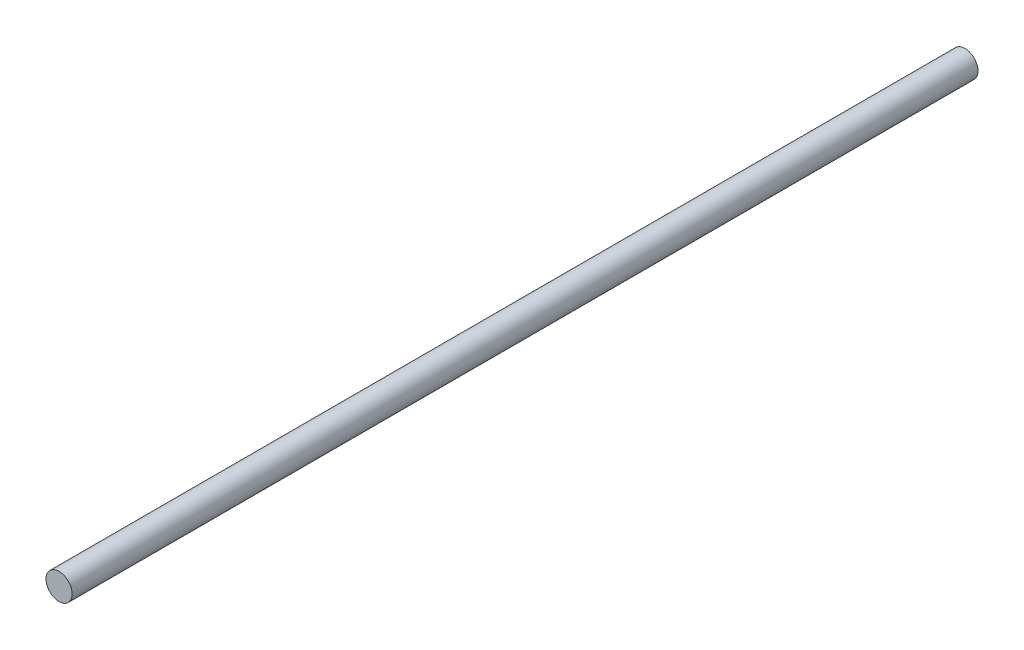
ISO-10303-21;
HEADER;
FILE_DESCRIPTION(('STEP AP214'),'2;1');
FILE_NAME('part.step','',(''),(''),'','','');
FILE_SCHEMA(('AUTOMOTIVE_DESIGN { 1 0 10303 214 1 1 1 1 }'));
ENDSEC;
DATA;
#1=APPLICATION_CONTEXT('core data for automotive mechanical design processes');
#2=APPLICATION_PROTOCOL_DEFINITION('international standard','automotive_design',2000,#1);
#3=PRODUCT_CONTEXT('',#1,'mechanical');
#4=PRODUCT('Part','Part','',(#3));
#5=PRODUCT_RELATED_PRODUCT_CATEGORY('part','',(#4));
#6=PRODUCT_DEFINITION_FORMATION('','',#4);
#7=PRODUCT_DEFINITION_CONTEXT('part definition',#1,'design');
#8=PRODUCT_DEFINITION('design','',#6,#7);
#9=PRODUCT_DEFINITION_SHAPE('','',#8);
#10=(LENGTH_UNIT() NAMED_UNIT(*) SI_UNIT(.MILLI.,.METRE.));
#11=(NAMED_UNIT(*) PLANE_ANGLE_UNIT() SI_UNIT($,.RADIAN.));
#12=(NAMED_UNIT(*) SI_UNIT($,.STERADIAN.) SOLID_ANGLE_UNIT());
#13=UNCERTAINTY_MEASURE_WITH_UNIT(LENGTH_MEASURE(1.E-05),#10,'distance_accuracy_value','');
#14=(GEOMETRIC_REPRESENTATION_CONTEXT(3) GLOBAL_UNCERTAINTY_ASSIGNED_CONTEXT((#13)) GLOBAL_UNIT_ASSIGNED_CONTEXT((#10,
#11,#12)) REPRESENTATION_CONTEXT('',''));
#15=CARTESIAN_POINT('',(0.,0.,0.));
#16=DIRECTION('',(0.,0.,1.));
#17=DIRECTION('',(1.,0.,0.));
#18=AXIS2_PLACEMENT_3D('',#15,#16,#17);
#19=CARTESIAN_POINT('',(0.,0.,220.));
#20=DIRECTION('',(0.,0.,-1.));
#21=DIRECTION('',(-1.,0.,0.));
#22=AXIS2_PLACEMENT_3D('',#19,#20,#21);
#23=CYLINDRICAL_SURFACE('',#22,3.175);
#24=CARTESIAN_POINT('',(0.,0.,220.));
#25=DIRECTION('',(0.,0.,1.));
#26=DIRECTION('',(1.,0.,0.));
#27=AXIS2_PLACEMENT_3D('',#24,#25,#26);
#28=CIRCLE('',#27,3.175);
#29=CARTESIAN_POINT('',(3.175,0.,220.));
#30=VERTEX_POINT('',#29);
#31=EDGE_CURVE('E10',#30,#30,#28,.T.);
#32=ORIENTED_EDGE('',*,*,#31,.F.);
#33=EDGE_LOOP('',(#32));
#34=FACE_BOUND('',#33,.T.);
#35=CARTESIAN_POINT('',(0.,0.,0.));
#36=DIRECTION('',(0.,0.,1.));
#37=DIRECTION('',(1.,0.,0.));
#38=AXIS2_PLACEMENT_3D('',#35,#36,#37);
#39=CIRCLE('',#38,3.175);
#40=CARTESIAN_POINT('',(3.175,0.,0.));
#41=VERTEX_POINT('',#40);
#42=EDGE_CURVE('E32',#41,#41,#39,.T.);
#43=ORIENTED_EDGE('',*,*,#42,.T.);
#44=EDGE_LOOP('',(#43));
#45=FACE_BOUND('',#44,.T.);
#46=ADVANCED_FACE('F29',(#34,#45),#23,.T.);
#47=CARTESIAN_POINT('',(0.,0.,220.));
#48=DIRECTION('',(0.,0.,1.));
#49=DIRECTION('',(1.,0.,0.));
#50=AXIS2_PLACEMENT_3D('',#47,#48,#49);
#51=PLANE('',#50);
#52=ORIENTED_EDGE('',*,*,#31,.T.);
#53=EDGE_LOOP('',(#52));
#54=FACE_BOUND('',#53,.T.);
#55=ADVANCED_FACE('F44',(#54),#51,.T.);
#56=CARTESIAN_POINT('',(0.,0.,0.));
#57=DIRECTION('',(0.,0.,1.));
#58=DIRECTION('',(1.,0.,0.));
#59=AXIS2_PLACEMENT_3D('',#56,#57,#58);
#60=PLANE('',#59);
#61=ORIENTED_EDGE('',*,*,#42,.F.);
#62=EDGE_LOOP('',(#61));
#63=FACE_BOUND('',#62,.T.);
#64=ADVANCED_FACE('F42',(#63),#60,.F.);
#65=CLOSED_SHELL('',(#46,#55,#64));
#66=MANIFOLD_SOLID_BREP('B2',#65);
#67=ADVANCED_BREP_SHAPE_REPRESENTATION('',(#18,#66),#14);
#68=SHAPE_DEFINITION_REPRESENTATION(#9,#67);
ENDSEC;
END-ISO-10303-21;
